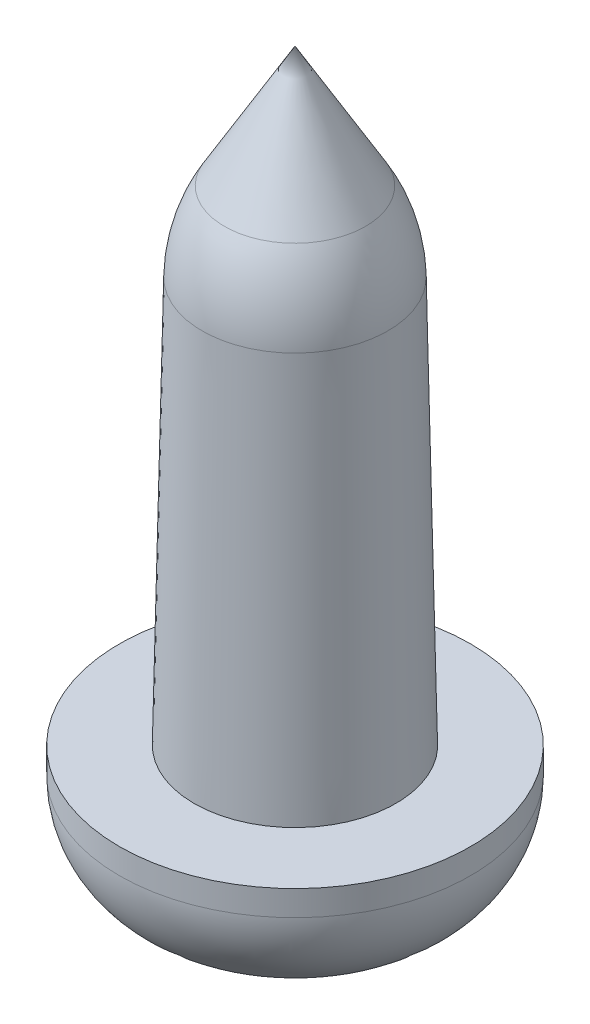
from build123d import *

# Parameters (mm, degrees)
ENL_V_MAT_EXTRU_1_DEPTH = 1
ENL_V_MAT_EXTRU_1_DRAFT = -12


with BuildPart() as part:
    # Esquisse1 → Base-R_volution (revolve)
    with BuildSketch(Plane.XY, mode=Mode.PRIVATE) as base_r_volution_sk:
        with BuildLine():
            Line((0, 0), (0.740011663, 8.631e-06))
            ThreePointArc((0.740011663, 8.631e-06), (1.447110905, 0.292905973), (1.74, 1.000008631))
            Line((1.74, 1.000008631), (1.74, 1.25))
            Line((1.74, 1.25), (1, 1.25))
            Line((1, 1.25), (0.920196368, 5.264941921))
            ThreePointArc((0.920196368, 5.264941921), (0.859909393, 5.672312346), (0.69915566, 6.05144744))
            Line((0.69915566, 6.05144744), (0, 7.25))
            Line((0, 7.25), (0, 0))
        make_face()
    revolve(base_r_volution_sk.sketch.rotate(Axis((0, 0, 0), (0, 1, 0)), 90), axis=Axis((0, 0, 0), (0, 1, 0)))


with BuildPart() as enl_v_mat_extru_1_tool:
    # Esquisse2 → Enl_v. mat.-Extru.1 (with draft: the straight prism first)
    with BuildSketch(Plane.XZ):
        with BuildLine():
            Line((0.35, -1.5), (0.35, -0.55))
            ThreePointArc((0.35, -0.55), (0.408578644, -0.408578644), (0.55, -0.35))
            Line((0.55, -0.35), (1.5, -0.35))
            Line((1.5, -0.35), (1.5, 0.35))
            Line((1.5, 0.35), (0.55, 0.35))
            ThreePointArc((0.55, 0.35), (0.408578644, 0.408578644), (0.35, 0.55))
            Line((0.35, 0.55), (0.35, 1.5))
            Line((0.35, 1.5), (-0.35, 1.5))
            Line((-0.35, 1.5), (-0.35, 0.55))
            ThreePointArc((-0.35, 0.55), (-0.408578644, 0.408578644), (-0.55, 0.35))
            Line((-0.55, 0.35), (-1.5, 0.35))
            Line((-1.5, 0.35), (-1.5, -0.35))
            Line((-1.5, -0.35), (-0.55, -0.35))
            ThreePointArc((-0.55, -0.35), (-0.408578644, -0.408578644), (-0.35, -0.55))
            Line((-0.35, -0.55), (-0.35, -1.5))
            Line((-0.35, -1.5), (0.35, -1.5))
        make_face()
    extrude(amount=-ENL_V_MAT_EXTRU_1_DEPTH)
    # Enl_v. mat.-Extru.1: the draft: its side faces are tilted about the plane it starts from
    enl_v_mat_extru_1_sides = [enl_v_mat_extru_1_tool.faces().sort_by_distance(p)[0] for p in [
        (-0.35, 0.5, -1.025),
        (0, 0.5, -1.5),
        (0.35, 0.5, -1.025),
        (0.408578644, 0.5, -0.408578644),
        (1.025, 0.5, -0.35),
        (1.5, 0.5, 0),
        (1.025, 0.5, 0.35),
        (0.408578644, 0.5, 0.408578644),
        (0.35, 0.5, 1.025),
        (0, 0.5, 1.5),
        (-0.35, 0.5, 1.025),
        (-0.408578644, 0.5, 0.408578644),
        (-1.025, 0.5, 0.35),
        (-1.5, 0.5, 0),
        (-1.025, 0.5, -0.35),
        (-0.408578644, 0.5, -0.408578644),
    ]]
    draft(enl_v_mat_extru_1_sides, Plane.XZ, ENL_V_MAT_EXTRU_1_DRAFT)


with BuildPart() as part_1:
    add(part.part)

    # Enl_v. mat.-Extru.1: cut by enl_v_mat_extru_1_tool
    add(enl_v_mat_extru_1_tool.part, mode=Mode.SUBTRACT)


solid = part_1.part
